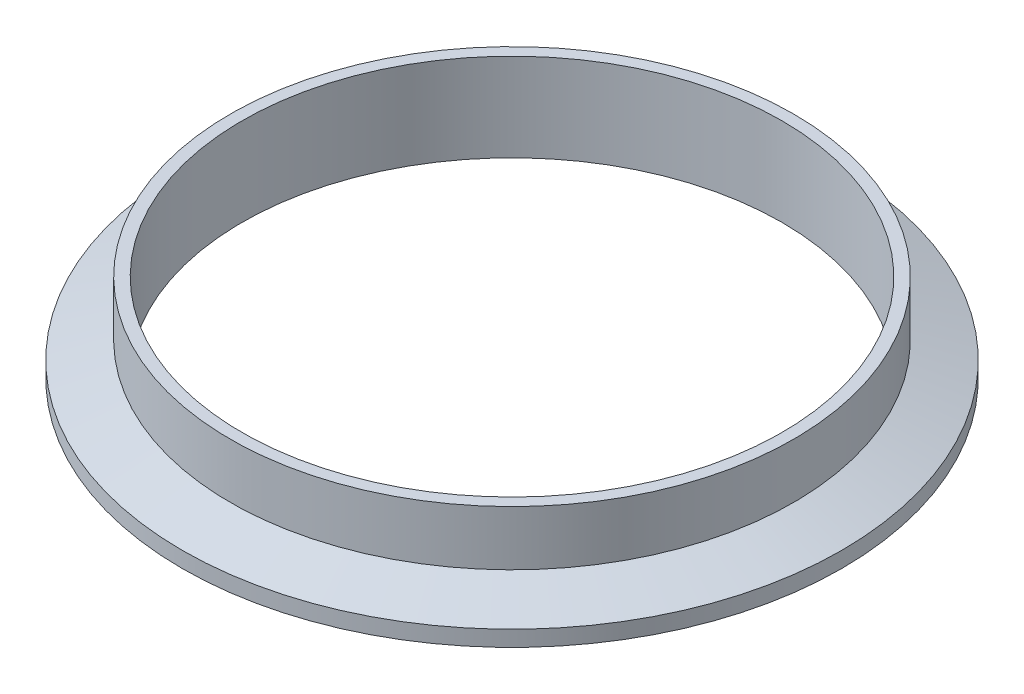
from build123d import *


with BuildPart() as part:
    # Sketch1 → Revolve2 (revolve)
    with BuildSketch(Plane.XY, mode=Mode.PRIVATE) as revolve2_sk:
        with BuildLine():
            Line((-48.6918, 0), (-48.6918, 15.875))
            Line((-48.6918, 15.875), (-50.8, 15.875))
            Line((-50.8, 15.875), (-50.8, 5.997291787))
            Line((-50.8, 5.997291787), (-59.4614, 2.8448))
            Line((-59.4614, 2.8448), (-59.4614, 0))
            Line((-59.4614, 0), (-56.618508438, 0))
            ThreePointArc((-56.618508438, 0), (-56.186311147, 0.129217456), (-55.895966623, 0.474458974))
            ThreePointArc((-55.895966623, 0.474458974), (-54.8005, 1.1938), (-53.705033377, 0.474458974))
            ThreePointArc((-53.705033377, 0.474458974), (-53.414688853, 0.129217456), (-52.982491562, 0))
            Line((-52.982491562, 0), (-48.6918, 0))
        make_face()
    revolve(revolve2_sk.sketch.rotate(Axis((0, 0, 0), (0, 1, 0)), 270), axis=Axis((0, 0, 0), (0, 1, 0)))


solid = part.part
